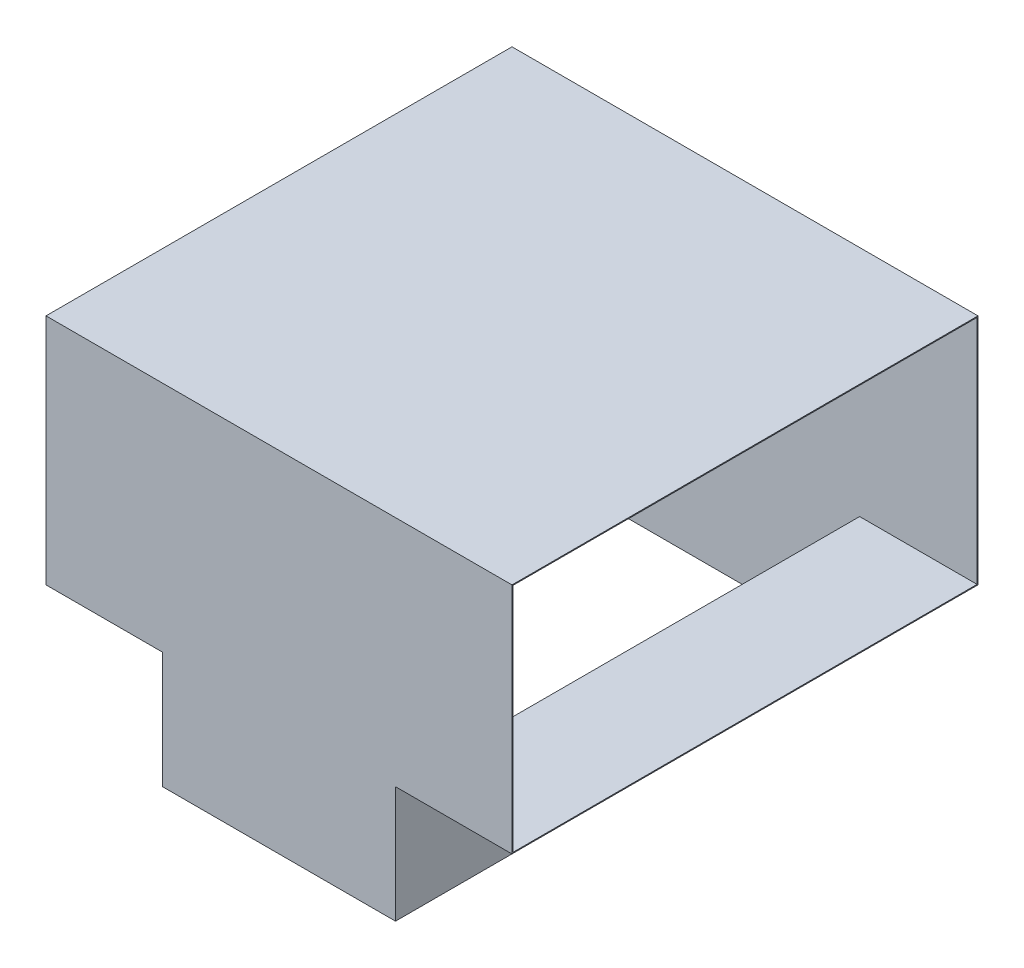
from build123d import *

# Parameters (mm, degrees)
SKETCH1_W           = 1000
SKETCH1_H           = 500
SKETCH1_W_2         = 996
SKETCH1_H_2         = 496
EXTRUDE_THIN1_DEPTH = 500
SKETCH2_W           = 500
SKETCH2_H           = 1000
SKETCH2_W_2         = 496
SKETCH2_H_2         = 996
EXTRUDE_THIN2_DEPTH = 250
CUT_EXTRUDE1_REACH  = 1032.776
SKETCH3_W           = 496
SKETCH3_H           = 996


with BuildPart() as part:
    # Sketch1 → Extrude-Thin1 (new, symmetric)
    with BuildSketch(Plane(origin=(0, 0, 0), x_dir=(0, 0, -1), z_dir=(1, 0, 0))):
        Rectangle(SKETCH1_W, SKETCH1_H)
        Rectangle(SKETCH1_W_2, SKETCH1_H_2, mode=Mode.SUBTRACT)
    extrude(amount=EXTRUDE_THIN1_DEPTH, both=True)

    # Sketch2 → Extrude-Thin2 (add)
    with BuildSketch(Plane.XZ.offset(250)):
        Rectangle(SKETCH2_W, SKETCH2_H)
        Rectangle(SKETCH2_W_2, SKETCH2_H_2, mode=Mode.SUBTRACT)
    extrude(amount=EXTRUDE_THIN2_DEPTH)

    # Sketch3 → Cut-Extrude1 (cut, up to next)
    with BuildSketch(Plane.XZ.offset(500), mode=Mode.PRIVATE) as cut_extrude1_sk1:
        Rectangle(SKETCH3_W, SKETCH3_H)
    cut_extrude1_tool1 = extrude(cut_extrude1_sk1.sketch, amount=-CUT_EXTRUDE1_REACH, mode=Mode.PRIVATE) & part.part
    add(cut_extrude1_tool1.solids().sort_by_distance((0, -500, 0))[0], mode=Mode.SUBTRACT)


solid = part.part
